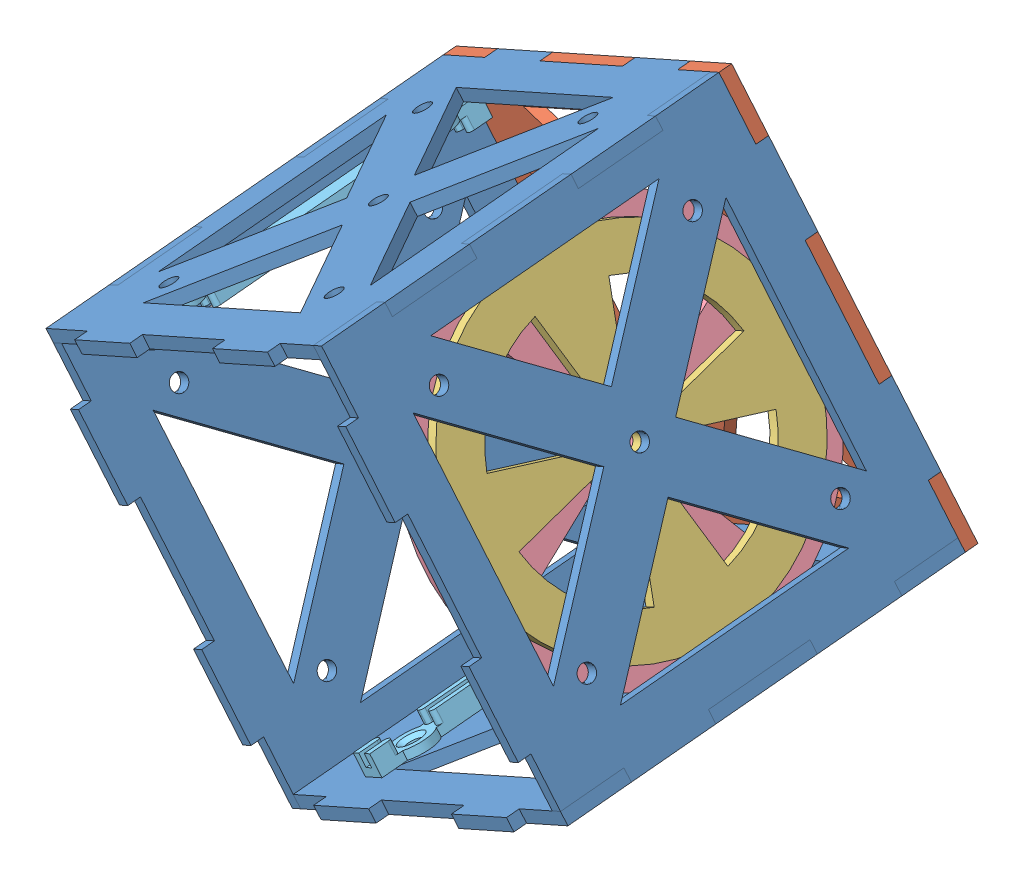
SolidWorks assembly Cube.SLDASM, configuration Défaut (file format 9000). Lengths in mm.
Overall size (144.76 152.45 126.85).
10 component instances, 5 part files, 20 mates.
Components (placement in the parent):
- CubeSide-1: CubeSide.SLDPRT [Défaut] at (19.311 -35.1716 114.9759) x (-0.862492 -0.477185 -0.168529) z (0.498619 -0.858225 -0.121776) size (100 100 3)
- CubeSide-2: CubeSide.SLDPRT [Défaut] at (-31.9797 29.2783 122.8961) x (-0.498619 0.858225 0.121776) z (-0.862492 -0.477185 -0.168529) size (100 100 3)
- Cube-2: Cube.SLDPRT [Défaut] at (92.6174 12.2763 27.9603) x (0.862492 0.477185 0.168529) z (-0.086526 -0.189063 0.978145) size (100 100 3)
- CubeSide-4: CubeSide.SLDPRT [Défaut] at (32.559 78.7627 138.1699) x (0.862492 0.477185 0.168529) z (-0.498619 0.858225 0.121776) size (100 100 3)
- CubeSide-5: CubeSide.SLDPRT [Défaut] at (83.8497 14.3129 130.2497) x (0.498619 -0.858225 -0.121776) z (0.862492 0.477185 0.168529) size (100 100 3)
- Cube-3: Cube.SLDPRT [Défaut] at (84.2243 -6.0628 122.8404) x (0.862492 0.477185 0.168529) z (-0.086526 -0.189063 0.978145) size (100 100 3) (hidden)
- wheelXS-1: wheelXS.SLDPRT [Défaut] at (70.0875 55.0446 85.3511) x (-0.131807 -0.109706 0.985186) z (-0.862492 -0.477185 -0.168529) size (80 80 3)
- wheelS-1: wheelS.SLDPRT [Défaut] at (64.9125 52.1815 84.3399) x (0.001602 0.33044 -0.943826) z (0.862492 0.477185 0.168529) size (90 90 3)
- Rail-1: Rail.SLDPRT [Défaut] at (-15.0167 59.5978 78.4344) x (0.862492 0.477185 0.168529) z (0.498619 -0.858225 -0.121776) size (10 80 5)
- Rail-2: Rail.SLDPRT [Défaut] at (34.3955 -19.743 68.0067) x (0.862492 0.477185 0.168529) z (-0.498619 0.858225 0.121776) size (10 80 5)
Mates (geometry in assembly coordinates):
- Coïncidente3: coincident aligned: line of CubeSide-1 through (49.6043 0.8975 112.9408) axis (0.015837 -0.031484 0.999379); line of CubeSide-2 through (49.6043 0.8975 112.9408) axis (0.015837 -0.031484 0.999379)
- Coïncidente9: coincident anti-aligned: line of CubeSide-1 through (47.8154 -1.5103 112.8933) axis (0.596277 0.802623 0.015837); line of CubeSide-2 through (49.6043 0.8975 112.9408) axis (-0.596277 -0.802623 -0.015837)
- Coïncidente12: coincident aligned: line of CubeSide-1 through (55.461 13.1107 31.1818) axis (0.015837 -0.031484 0.999379); line of Cube-2 through (55.461 13.1107 31.1818) axis (0.015837 -0.031484 0.999379)
- Coïncidente13: coincident anti-aligned: plane of CubeSide-1; plane of Cube-2
- Coïncidente14: coincident anti-aligned: plane of Cube-2 through (100.8046 68.243 35.202) normal (0.015837 -0.031484 0.999379); plane of CubeSide-4 through (16.897 128.6462 38.4345) normal (-0.015837 0.031484 -0.999379)
- Coïncidente20: coincident: line of Cube-2 through (-22.3459 70.7948 37.2339) axis (0.596277 0.802623 0.015837); plane of CubeSide-4 through (20.8478 123.7918 135.707) normal (0.802623 -0.595655 -0.031484)
- Coïncidente21: coincident anti-aligned: plane of CubeSide-4 through (20.8478 123.7918 135.707) normal (0.802623 -0.595655 -0.031484); plane of CubeSide-5 through (27.7992 134.1219 117.4834) normal (-0.802623 0.595655 0.031484)
- Parallèle4: parallel aligned: line of CubeSide-5 through (25.392 135.9096 117.5779) axis (0.015837 -0.031484 0.999379); line of CubeSide-4 through (25.392 135.9096 117.5779) axis (0.015837 -0.031484 0.999379)
- Coïncidente23: coincident anti-aligned: plane of CubeSide-4 through (25.6838 135.3295 135.9939) normal (0.596277 0.802623 0.015837); plane of CubeSide-5 through (93.7875 84.7872 133.3224) normal (-0.596277 -0.802623 -0.015837)
- Coïncidente24: coincident anti-aligned: plane of CubeSide-4 through (27.1808 138.3175 117.6254) normal (0.015837 -0.031484 0.999379); plane of CubeSide-5 through (25.3914 135.9088 117.5778) normal (-0.015837 0.031484 -0.999379)
- Coïncidente25: coincident aligned: line of CubeSide-4 through (9.004 107.872 134.9655) axis (0.596277 0.802623 0.015837); line of Cube-3 through (9.004 107.872 134.9655) axis (0.596277 0.802623 0.015837)
- Coïncidente26: coincident aligned: line of CubeSide-4 through (6.5962 109.659 135.0599) axis (0.802623 -0.595655 -0.031484); line of Cube-3 through (6.5962 109.659 135.0599) axis (0.802623 -0.595655 -0.031484)
- Coïncidente27: coincident anti-aligned: circle of CubeSide-5; circle of wheelXS-1
- Coïncidente29: coincident anti-aligned: circle of wheelXS-1; circle of wheelS-1
- Coïncidente30: coincident aligned: line of CubeSide-1 through (105.0352 80.5389 114.5714) axis (0.015837 -0.031484 0.999379); line of CubeSide-5 through (105.0352 80.5389 114.5714) axis (0.015837 -0.031484 0.999379)
- Coïncidente32: coincident anti-aligned: plane of Cube-2 through (36.1327 129.5565 35.1555) normal (0.596277 0.802623 0.015837); plane of CubeSide-5 through (93.7875 84.7872 133.3224) normal (-0.596277 -0.802623 -0.015837)
- Coïncidente33: coincident: circle of CubeSide-4; circle of Rail-1
- Coïncidente34: coincident anti-aligned: circle of CubeSide-4; circle of Rail-1
- Coïncidente35: coincident: circle of CubeSide-1; circle of Rail-2
- Coïncidente36: coincident anti-aligned: circle of CubeSide-1; circle of Rail-2
